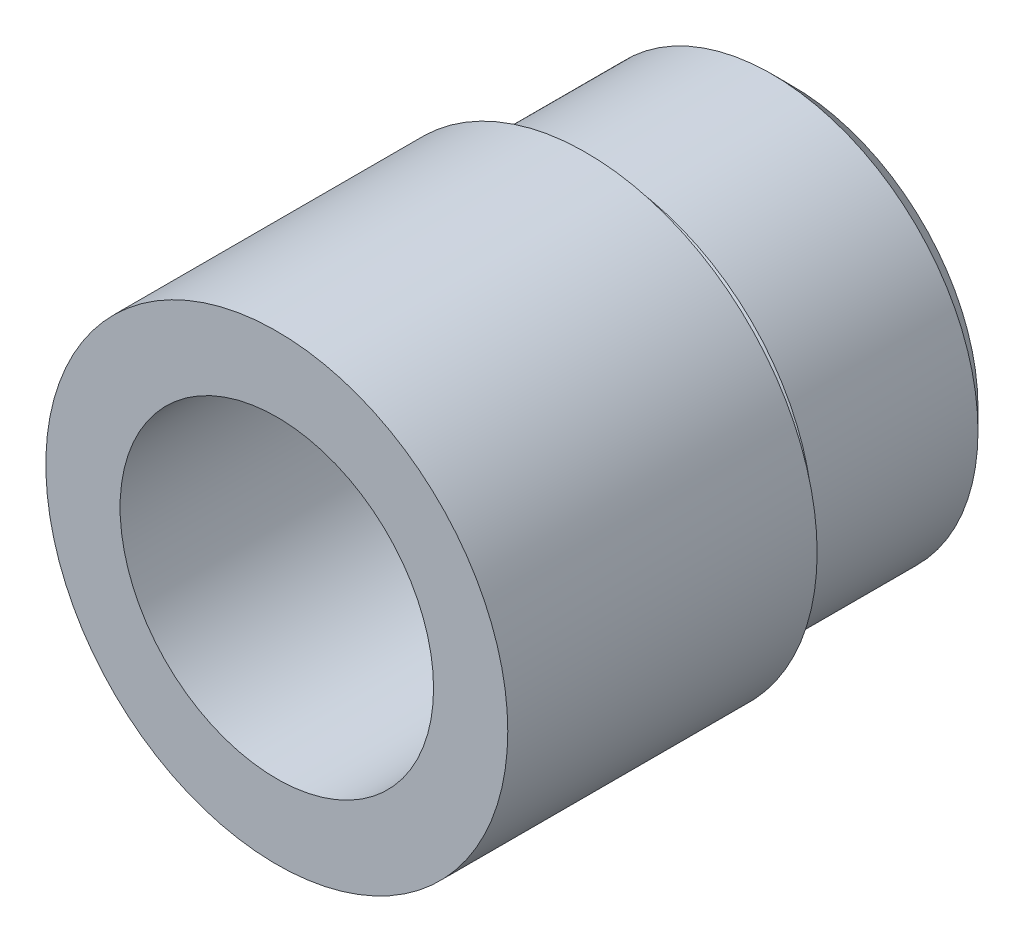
ISO-10303-21;
HEADER;
FILE_DESCRIPTION(('STEP AP214'),'2;1');
FILE_NAME('part.step','',(''),(''),'','','');
FILE_SCHEMA(('AUTOMOTIVE_DESIGN { 1 0 10303 214 1 1 1 1 }'));
ENDSEC;
DATA;
#1=APPLICATION_CONTEXT('core data for automotive mechanical design processes');
#2=APPLICATION_PROTOCOL_DEFINITION('international standard','automotive_design',2000,#1);
#3=PRODUCT_CONTEXT('',#1,'mechanical');
#4=PRODUCT('Part','Part','',(#3));
#5=PRODUCT_RELATED_PRODUCT_CATEGORY('part','',(#4));
#6=PRODUCT_DEFINITION_FORMATION('','',#4);
#7=PRODUCT_DEFINITION_CONTEXT('part definition',#1,'design');
#8=PRODUCT_DEFINITION('design','',#6,#7);
#9=PRODUCT_DEFINITION_SHAPE('','',#8);
#10=(LENGTH_UNIT() NAMED_UNIT(*) SI_UNIT(.MILLI.,.METRE.));
#11=(NAMED_UNIT(*) PLANE_ANGLE_UNIT() SI_UNIT($,.RADIAN.));
#12=(NAMED_UNIT(*) SI_UNIT($,.STERADIAN.) SOLID_ANGLE_UNIT());
#13=UNCERTAINTY_MEASURE_WITH_UNIT(LENGTH_MEASURE(1.E-05),#10,'distance_accuracy_value','');
#14=(GEOMETRIC_REPRESENTATION_CONTEXT(3) GLOBAL_UNCERTAINTY_ASSIGNED_CONTEXT((#13)) GLOBAL_UNIT_ASSIGNED_CONTEXT((#10,
#11,#12)) REPRESENTATION_CONTEXT('',''));
#15=CARTESIAN_POINT('',(0.,0.,0.));
#16=DIRECTION('',(0.,0.,1.));
#17=DIRECTION('',(1.,0.,0.));
#18=AXIS2_PLACEMENT_3D('',#15,#16,#17);
#19=CARTESIAN_POINT('',(0.,0.,0.));
#20=DIRECTION('',(0.,0.,1.));
#21=DIRECTION('',(1.,0.,0.));
#22=AXIS2_PLACEMENT_3D('',#19,#20,#21);
#23=CYLINDRICAL_SURFACE('',#22,14.224);
#24=CARTESIAN_POINT('',(0.,0.,-16.3949652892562));
#25=DIRECTION('',(0.,0.,1.));
#26=DIRECTION('',(1.,0.,0.));
#27=AXIS2_PLACEMENT_3D('',#24,#25,#26);
#28=CIRCLE('',#27,14.224);
#29=CARTESIAN_POINT('',(14.224,0.,-16.3949652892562));
#30=VERTEX_POINT('',#29);
#31=EDGE_CURVE('E57',#30,#30,#28,.T.);
#32=ORIENTED_EDGE('',*,*,#31,.F.);
#33=EDGE_LOOP('',(#32));
#34=FACE_BOUND('',#33,.T.);
#35=CARTESIAN_POINT('',(0.,0.,-35.4449652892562));
#36=DIRECTION('',(0.,0.,1.));
#37=DIRECTION('',(1.,0.,0.));
#38=AXIS2_PLACEMENT_3D('',#35,#36,#37);
#39=CIRCLE('',#38,14.224);
#40=CARTESIAN_POINT('',(14.224,0.,-35.4449652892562));
#41=VERTEX_POINT('',#40);
#42=EDGE_CURVE('E10',#41,#41,#39,.T.);
#43=ORIENTED_EDGE('',*,*,#42,.T.);
#44=EDGE_LOOP('',(#43));
#45=FACE_BOUND('',#44,.T.);
#46=ADVANCED_FACE('F29',(#34,#45),#23,.T.);
#47=CARTESIAN_POINT('',(0.,14.224,-35.4449652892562));
#48=DIRECTION('',(0.,0.,1.));
#49=DIRECTION('',(1.,0.,0.));
#50=AXIS2_PLACEMENT_3D('',#47,#48,#49);
#51=PLANE('',#50);
#52=ORIENTED_EDGE('',*,*,#42,.F.);
#53=EDGE_LOOP('',(#52));
#54=FACE_BOUND('',#53,.T.);
#55=CARTESIAN_POINT('',(0.,0.,-35.4449652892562));
#56=DIRECTION('',(0.,0.,1.));
#57=DIRECTION('',(1.,0.,0.));
#58=AXIS2_PLACEMENT_3D('',#55,#56,#57);
#59=CIRCLE('',#58,11.43);
#60=CARTESIAN_POINT('',(11.43,0.,-35.4449652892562));
#61=VERTEX_POINT('',#60);
#62=EDGE_CURVE('E35',#61,#61,#59,.T.);
#63=ORIENTED_EDGE('',*,*,#62,.T.);
#64=EDGE_LOOP('',(#63));
#65=FACE_BOUND('',#64,.T.);
#66=ADVANCED_FACE('F64',(#54,#65),#51,.F.);
#67=CARTESIAN_POINT('',(0.,0.,-36.7149652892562));
#68=DIRECTION('',(0.,0.,-1.));
#69=DIRECTION('',(-1.,0.,0.));
#70=AXIS2_PLACEMENT_3D('',#67,#68,#69);
#71=CONICAL_SURFACE('',#70,12.7,0.785398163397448);
#72=ORIENTED_EDGE('',*,*,#62,.F.);
#73=EDGE_LOOP('',(#72));
#74=FACE_BOUND('',#73,.T.);
#75=CARTESIAN_POINT('',(0.,0.,-36.7149652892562));
#76=DIRECTION('',(0.,0.,1.));
#77=DIRECTION('',(1.,0.,0.));
#78=AXIS2_PLACEMENT_3D('',#75,#76,#77);
#79=CIRCLE('',#78,12.7);
#80=CARTESIAN_POINT('',(12.7,0.,-36.7149652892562));
#81=VERTEX_POINT('',#80);
#82=EDGE_CURVE('E39',#81,#81,#79,.T.);
#83=ORIENTED_EDGE('',*,*,#82,.T.);
#84=EDGE_LOOP('',(#83));
#85=FACE_BOUND('',#84,.T.);
#86=ADVANCED_FACE('F68',(#74,#85),#71,.T.);
#87=CARTESIAN_POINT('',(0.,0.,0.));
#88=DIRECTION('',(0.,0.,1.));
#89=DIRECTION('',(1.,0.,0.));
#90=AXIS2_PLACEMENT_3D('',#87,#88,#89);
#91=CYLINDRICAL_SURFACE('',#90,12.7);
#92=ORIENTED_EDGE('',*,*,#82,.F.);
#93=EDGE_LOOP('',(#92));
#94=FACE_BOUND('',#93,.T.);
#95=CARTESIAN_POINT('',(0.,0.,-46.8749652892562));
#96=DIRECTION('',(0.,0.,1.));
#97=DIRECTION('',(1.,0.,0.));
#98=AXIS2_PLACEMENT_3D('',#95,#96,#97);
#99=CIRCLE('',#98,12.7);
#100=CARTESIAN_POINT('',(12.7,0.,-46.8749652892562));
#101=VERTEX_POINT('',#100);
#102=EDGE_CURVE('E43',#101,#101,#99,.T.);
#103=ORIENTED_EDGE('',*,*,#102,.T.);
#104=EDGE_LOOP('',(#103));
#105=FACE_BOUND('',#104,.T.);
#106=ADVANCED_FACE('F73',(#94,#105),#91,.T.);
#107=CARTESIAN_POINT('',(0.,0.,-48.1449652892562));
#108=DIRECTION('',(0.,0.,1.));
#109=DIRECTION('',(1.,0.,0.));
#110=AXIS2_PLACEMENT_3D('',#107,#108,#109);
#111=CONICAL_SURFACE('',#110,11.43,0.785398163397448);
#112=ORIENTED_EDGE('',*,*,#102,.F.);
#113=EDGE_LOOP('',(#112));
#114=FACE_BOUND('',#113,.T.);
#115=CARTESIAN_POINT('',(0.,0.,-48.1449652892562));
#116=DIRECTION('',(0.,0.,1.));
#117=DIRECTION('',(1.,0.,0.));
#118=AXIS2_PLACEMENT_3D('',#115,#116,#117);
#119=CIRCLE('',#118,11.43);
#120=CARTESIAN_POINT('',(11.43,0.,-48.1449652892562));
#121=VERTEX_POINT('',#120);
#122=EDGE_CURVE('E48',#121,#121,#119,.T.);
#123=ORIENTED_EDGE('',*,*,#122,.T.);
#124=EDGE_LOOP('',(#123));
#125=FACE_BOUND('',#124,.T.);
#126=ADVANCED_FACE('F79',(#114,#125),#111,.T.);
#127=CARTESIAN_POINT('',(0.,11.43,-48.1449652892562));
#128=DIRECTION('',(0.,0.,1.));
#129=DIRECTION('',(1.,0.,0.));
#130=AXIS2_PLACEMENT_3D('',#127,#128,#129);
#131=PLANE('',#130);
#132=ORIENTED_EDGE('',*,*,#122,.F.);
#133=EDGE_LOOP('',(#132));
#134=FACE_BOUND('',#133,.T.);
#135=CARTESIAN_POINT('',(0.,0.,-48.1449652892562));
#136=DIRECTION('',(0.,0.,1.));
#137=DIRECTION('',(1.,0.,0.));
#138=AXIS2_PLACEMENT_3D('',#135,#136,#137);
#139=CIRCLE('',#138,9.652);
#140=CARTESIAN_POINT('',(9.652,0.,-48.1449652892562));
#141=VERTEX_POINT('',#140);
#142=EDGE_CURVE('E51',#141,#141,#139,.T.);
#143=ORIENTED_EDGE('',*,*,#142,.T.);
#144=EDGE_LOOP('',(#143));
#145=FACE_BOUND('',#144,.T.);
#146=ADVANCED_FACE('F83',(#134,#145),#131,.F.);
#147=CARTESIAN_POINT('',(0.,0.,0.));
#148=DIRECTION('',(0.,0.,1.));
#149=DIRECTION('',(1.,0.,0.));
#150=AXIS2_PLACEMENT_3D('',#147,#148,#149);
#151=CYLINDRICAL_SURFACE('',#150,9.652);
#152=ORIENTED_EDGE('',*,*,#142,.F.);
#153=EDGE_LOOP('',(#152));
#154=FACE_BOUND('',#153,.T.);
#155=CARTESIAN_POINT('',(0.,0.,-16.3949652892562));
#156=DIRECTION('',(0.,0.,1.));
#157=DIRECTION('',(1.,0.,0.));
#158=AXIS2_PLACEMENT_3D('',#155,#156,#157);
#159=CIRCLE('',#158,9.652);
#160=CARTESIAN_POINT('',(9.652,0.,-16.3949652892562));
#161=VERTEX_POINT('',#160);
#162=EDGE_CURVE('E54',#161,#161,#159,.T.);
#163=ORIENTED_EDGE('',*,*,#162,.T.);
#164=EDGE_LOOP('',(#163));
#165=FACE_BOUND('',#164,.T.);
#166=ADVANCED_FACE('F87',(#154,#165),#151,.F.);
#167=CARTESIAN_POINT('',(0.,9.652,-16.3949652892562));
#168=DIRECTION('',(0.,0.,-1.));
#169=DIRECTION('',(-1.,0.,0.));
#170=AXIS2_PLACEMENT_3D('',#167,#168,#169);
#171=PLANE('',#170);
#172=ORIENTED_EDGE('',*,*,#162,.F.);
#173=EDGE_LOOP('',(#172));
#174=FACE_BOUND('',#173,.T.);
#175=ORIENTED_EDGE('',*,*,#31,.T.);
#176=EDGE_LOOP('',(#175));
#177=FACE_BOUND('',#176,.T.);
#178=ADVANCED_FACE('F61',(#174,#177),#171,.F.);
#179=CLOSED_SHELL('',(#46,#66,#86,#106,#126,#146,#166,#178));
#180=MANIFOLD_SOLID_BREP('B2',#179);
#181=ADVANCED_BREP_SHAPE_REPRESENTATION('',(#18,#180),#14);
#182=SHAPE_DEFINITION_REPRESENTATION(#9,#181);
ENDSEC;
END-ISO-10303-21;
